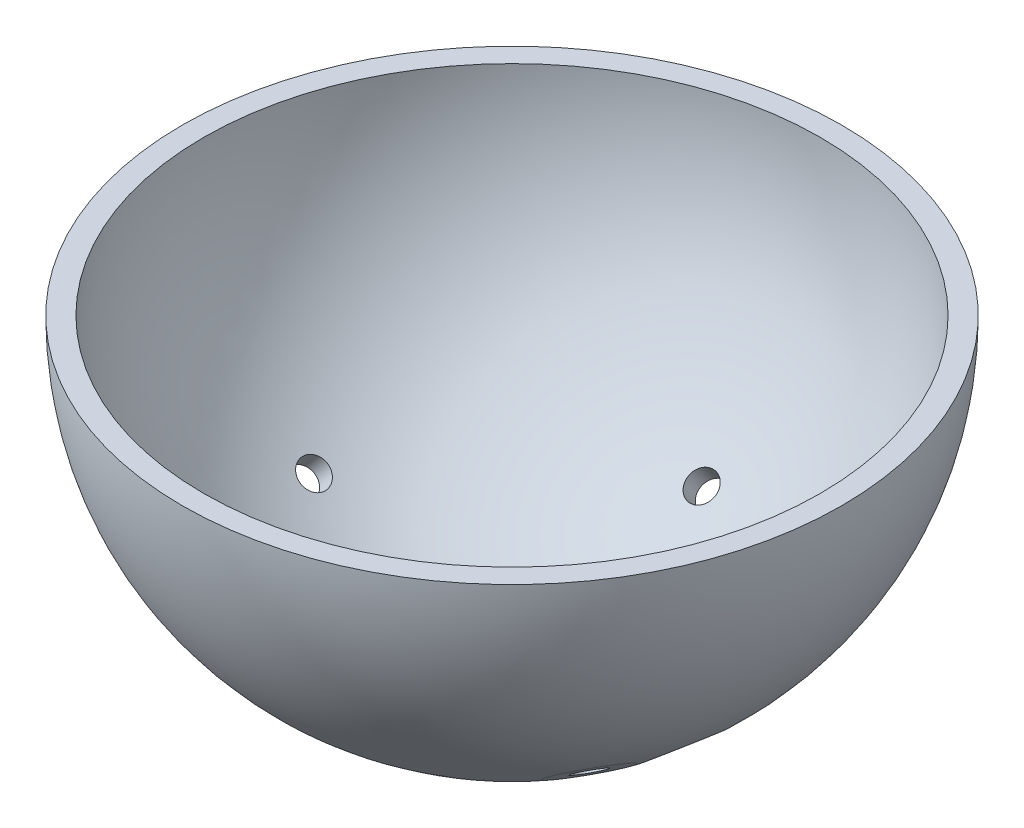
from build123d import *

# Parameters (mm, degrees)
CIRPATTERN1_COUNT = 4
CIRPATTERN1_ANGLE = 60


with BuildPart() as part:
    # Sketch1 → Revolve1 (revolve)
    with BuildSketch(Plane.XY):
        with BuildLine():
            Line((-215.9, 0), (-201.93, 0))
            ThreePointArc((-201.93, 0), (-142.786072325, -142.786072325), (0, -201.93))
            Line((0, -201.93), (0, -215.9))
            ThreePointArc((0, -215.9), (-152.664354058, -152.664354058), (-215.9, 0))
        make_face()
    revolve(axis=Axis((0, 91.568984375, 0), (0, -1, 0)))

    # Sketch13 → 3_4 Hole 1 (revolve, cut)
    with BuildSketch(Plane(origin=(0, 0, 0), x_dir=(0, 0, -1), z_dir=(1, 0, 0)), mode=Mode.PRIVATE) as f_3_4_hole_1_sk:
        Polygon((112.588695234, -144.106958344), (120.124520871, -138.219326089), (139.742871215, -163.329669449), (149.820661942, -155.456036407), (155.898172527, -163.234895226), (138.284556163, -176.996160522), align=None)
    revolve(f_3_4_hole_1_sk.sketch.rotate(Axis((0, 0, 0), (0, -0.7880107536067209, -0.6156614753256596)), 180), axis=Axis((0, 0, 0), (0, -0.7880107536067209, -0.6156614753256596)), mode=Mode.SUBTRACT)

    # Sketch15 → 3_4 Hole 5 (revolve, cut)
    with BuildSketch(Plane(origin=(0, 0, 0), x_dir=(0, 0, -1), z_dir=(1, 0, 0))):
        Polygon((-111.390811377, -142.573736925), (-118.926637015, -136.68610467), (-139.742871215, -163.329669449), (-149.820661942, -155.456036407), (-155.678138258, -162.953264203), (-138.064521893, -176.7145295), align=None)
    revolve(axis=Axis((0, 0, 0), (0, -0.7880107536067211, 0.6156614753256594)), mode=Mode.SUBTRACT)

    # Sketch12 → 3_4 Hole 6 (revolve, cut)
    with BuildSketch(Plane.XY):
        Polygon((-116.37065189, -138.685142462), (-123.696411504, -132.538100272), (-145.357866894, -158.353217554), (-155.154732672, -150.132671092), (-161.60932885, -157.824959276), (-144.486703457, -172.192547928), align=None)
    revolve(axis=Axis((0, 0, 0), (-0.6427876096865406, -0.766044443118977, 0)), mode=Mode.SUBTRACT)

    # Sketch17 → Cut-Revolve2 (revolve, cut)
    with BuildSketch(Plane(origin=(0, 0, 0), x_dir=(0, -1, 0), z_dir=(0.499999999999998, 0, 0.8660254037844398)), mode=Mode.PRIVATE) as cut_revolve2_sk:
        Polygon((145.024416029, 121.689934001), (138.901864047, 128.986507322), (158.377707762, 145.328680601), (150.132671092, 155.154732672), (153.419774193, 157.912939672), (167.787362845, 140.790314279), align=None)
    cut_revolve2 = revolve(cut_revolve2_sk.sketch.rotate(Axis((0, 0, 0), (0.5566703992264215, -0.7660444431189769, -0.32139380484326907)), 203.858654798), axis=Axis((0, 0, 0), (0.5566703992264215, -0.7660444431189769, -0.32139380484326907)), mode=Mode.SUBTRACT)

    # CirPattern1: Cut-Revolve2 ×4 about axis
    cirpattern1_axis = Axis((0, 0, 0), (0, -1, 0))
    for i in range(1, CIRPATTERN1_COUNT):
        add(cut_revolve2.rotate(cirpattern1_axis, i * CIRPATTERN1_ANGLE / (CIRPATTERN1_COUNT - 1)), mode=Mode.SUBTRACT)


solid = part.part
